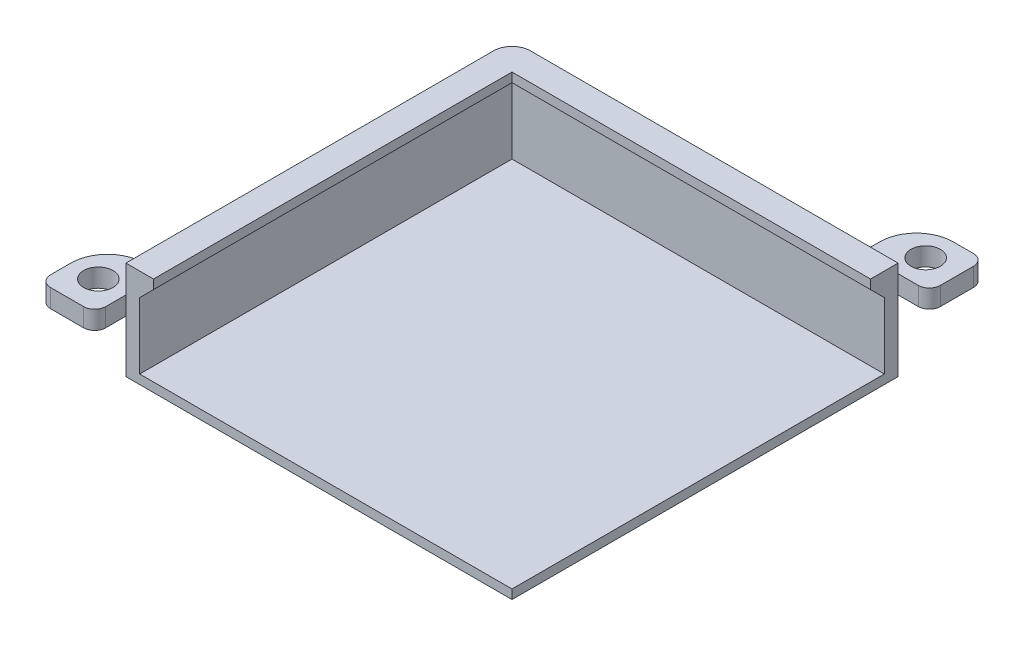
ISO-10303-21;
HEADER;
FILE_DESCRIPTION(('STEP AP214'),'2;1');
FILE_NAME('part.step','',(''),(''),'','','');
FILE_SCHEMA(('AUTOMOTIVE_DESIGN { 1 0 10303 214 1 1 1 1 }'));
ENDSEC;
DATA;
#1=APPLICATION_CONTEXT('core data for automotive mechanical design processes');
#2=APPLICATION_PROTOCOL_DEFINITION('international standard','automotive_design',2000,#1);
#3=PRODUCT_CONTEXT('',#1,'mechanical');
#4=PRODUCT('Part','Part','',(#3));
#5=PRODUCT_RELATED_PRODUCT_CATEGORY('part','',(#4));
#6=PRODUCT_DEFINITION_FORMATION('','',#4);
#7=PRODUCT_DEFINITION_CONTEXT('part definition',#1,'design');
#8=PRODUCT_DEFINITION('design','',#6,#7);
#9=PRODUCT_DEFINITION_SHAPE('','',#8);
#10=(LENGTH_UNIT() NAMED_UNIT(*) SI_UNIT(.MILLI.,.METRE.));
#11=(NAMED_UNIT(*) PLANE_ANGLE_UNIT() SI_UNIT($,.RADIAN.));
#12=(NAMED_UNIT(*) SI_UNIT($,.STERADIAN.) SOLID_ANGLE_UNIT());
#13=UNCERTAINTY_MEASURE_WITH_UNIT(LENGTH_MEASURE(1.E-05),#10,'distance_accuracy_value','');
#14=(GEOMETRIC_REPRESENTATION_CONTEXT(3) GLOBAL_UNCERTAINTY_ASSIGNED_CONTEXT((#13)) GLOBAL_UNIT_ASSIGNED_CONTEXT((#10,
#11,#12)) REPRESENTATION_CONTEXT('',''));
#15=CARTESIAN_POINT('',(0.,0.,0.));
#16=DIRECTION('',(0.,0.,1.));
#17=DIRECTION('',(1.,0.,0.));
#18=AXIS2_PLACEMENT_3D('',#15,#16,#17);
#19=CARTESIAN_POINT('',(-2.09403735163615,45.3038246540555,-96.5940373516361));
#20=DIRECTION('',(0.,-1.,0.));
#21=DIRECTION('',(0.,0.,-1.));
#22=AXIS2_PLACEMENT_3D('',#19,#20,#21);
#23=PLANE('',#22);
#24=CARTESIAN_POINT('',(92.4059626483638,45.3038246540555,-110.094037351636));
#25=DIRECTION('',(0.,1.,0.));
#26=DIRECTION('',(0.,0.,1.));
#27=AXIS2_PLACEMENT_3D('',#24,#25,#26);
#28=CIRCLE('',#27,7.19999999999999);
#29=CARTESIAN_POINT('',(92.4059626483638,45.3038246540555,-102.894037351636));
#30=VERTEX_POINT('',#29);
#31=EDGE_CURVE('E284',#30,#30,#28,.T.);
#32=ORIENTED_EDGE('',*,*,#31,.F.);
#33=EDGE_LOOP('',(#32));
#34=FACE_BOUND('',#33,.T.);
#35=DIRECTION('',(-1.,0.,0.));
#36=VECTOR('',#35,1.);
#37=CARTESIAN_POINT('',(92.4059626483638,45.3038246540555,-96.5940373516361));
#38=LINE('',#37,#36);
#39=CARTESIAN_POINT('',(92.4059626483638,45.3038246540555,-96.5940373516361));
#40=VERTEX_POINT('',#39);
#41=CARTESIAN_POINT('',(74.4059626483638,45.3038246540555,-96.5940373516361));
#42=VERTEX_POINT('',#41);
#43=EDGE_CURVE('E253',#40,#42,#38,.T.);
#44=ORIENTED_EDGE('',*,*,#43,.F.);
#45=DIRECTION('',(1.,0.,0.));
#46=VECTOR('',#45,1.);
#47=CARTESIAN_POINT('',(-2.09403735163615,45.3038246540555,-96.5940373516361));
#48=LINE('',#47,#46);
#49=CARTESIAN_POINT('',(102.305962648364,45.3038246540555,-96.5940373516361));
#50=VERTEX_POINT('',#49);
#51=EDGE_CURVE('E364',#40,#50,#48,.T.);
#52=ORIENTED_EDGE('',*,*,#51,.T.);
#53=CARTESIAN_POINT('',(102.305962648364,45.3038246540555,-101.994037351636));
#54=DIRECTION('',(0.,-1.,0.));
#55=DIRECTION('',(0.,0.,-1.));
#56=AXIS2_PLACEMENT_3D('',#53,#54,#55);
#57=CIRCLE('',#56,5.4);
#58=CARTESIAN_POINT('',(107.705962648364,45.3038246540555,-101.994037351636));
#59=VERTEX_POINT('',#58);
#60=EDGE_CURVE('E49',#50,#59,#57,.F.);
#61=ORIENTED_EDGE('',*,*,#60,.T.);
#62=DIRECTION('',(0.,0.,1.));
#63=VECTOR('',#62,1.);
#64=CARTESIAN_POINT('',(107.705962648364,45.3038246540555,-96.5940373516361));
#65=LINE('',#64,#63);
#66=CARTESIAN_POINT('',(107.705962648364,45.3038246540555,-118.194037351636));
#67=VERTEX_POINT('',#66);
#68=EDGE_CURVE('E293',#67,#59,#65,.T.);
#69=ORIENTED_EDGE('',*,*,#68,.F.);
#70=CARTESIAN_POINT('',(102.305962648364,45.3038246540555,-118.194037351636));
#71=DIRECTION('',(0.,-1.,0.));
#72=DIRECTION('',(0.,0.,-1.));
#73=AXIS2_PLACEMENT_3D('',#70,#71,#72);
#74=CIRCLE('',#73,5.4);
#75=CARTESIAN_POINT('',(102.305962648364,45.3038246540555,-123.594037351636));
#76=VERTEX_POINT('',#75);
#77=EDGE_CURVE('E56',#67,#76,#74,.F.);
#78=ORIENTED_EDGE('',*,*,#77,.T.);
#79=DIRECTION('',(1.,0.,0.));
#80=VECTOR('',#79,1.);
#81=CARTESIAN_POINT('',(-2.09403735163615,45.3038246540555,-123.594037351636));
#82=LINE('',#81,#80);
#83=CARTESIAN_POINT('',(92.4059626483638,45.3038246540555,-123.594037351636));
#84=VERTEX_POINT('',#83);
#85=EDGE_CURVE('E380',#84,#76,#82,.T.);
#86=ORIENTED_EDGE('',*,*,#85,.F.);
#87=CARTESIAN_POINT('',(92.4059626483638,45.3038246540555,-105.594037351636));
#88=DIRECTION('',(0.,1.,0.));
#89=DIRECTION('',(0.,0.,1.));
#90=AXIS2_PLACEMENT_3D('',#87,#88,#89);
#91=CIRCLE('',#90,18.);
#92=CARTESIAN_POINT('',(74.4059626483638,45.3038246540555,-105.594037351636));
#93=VERTEX_POINT('',#92);
#94=EDGE_CURVE('E369',#84,#93,#91,.T.);
#95=ORIENTED_EDGE('',*,*,#94,.T.);
#96=DIRECTION('',(0.,0.,1.));
#97=VECTOR('',#96,1.);
#98=CARTESIAN_POINT('',(74.4059626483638,45.3038246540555,-105.594037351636));
#99=LINE('',#98,#97);
#100=EDGE_CURVE('E397',#93,#42,#99,.T.);
#101=ORIENTED_EDGE('',*,*,#100,.T.);
#102=EDGE_LOOP('',(#44,#52,#61,#69,#78,#86,#95,#101));
#103=FACE_BOUND('',#102,.T.);
#104=ADVANCED_FACE('F40',(#34,#103),#23,.F.);
#105=CARTESIAN_POINT('',(-105.594037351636,27.3038246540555,92.4059626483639));
#106=DIRECTION('',(0.,1.,0.));
#107=DIRECTION('',(0.,0.,1.));
#108=AXIS2_PLACEMENT_3D('',#105,#106,#107);
#109=PLANE('',#108);
#110=CARTESIAN_POINT('',(-110.094037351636,27.3038246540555,92.4059626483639));
#111=DIRECTION('',(0.,1.,0.));
#112=DIRECTION('',(0.,0.,1.));
#113=AXIS2_PLACEMENT_3D('',#110,#111,#112);
#114=CIRCLE('',#113,7.20000000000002);
#115=CARTESIAN_POINT('',(-110.094037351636,27.3038246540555,99.6059626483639));
#116=VERTEX_POINT('',#115);
#117=EDGE_CURVE('E309',#116,#116,#114,.T.);
#118=ORIENTED_EDGE('',*,*,#117,.T.);
#119=EDGE_LOOP('',(#118));
#120=FACE_BOUND('',#119,.T.);
#121=DIRECTION('',(1.,0.,0.));
#122=VECTOR('',#121,1.);
#123=CARTESIAN_POINT('',(-123.594037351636,27.3038246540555,107.705962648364));
#124=LINE('',#123,#122);
#125=CARTESIAN_POINT('',(-118.194037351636,27.3038246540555,107.705962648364));
#126=VERTEX_POINT('',#125);
#127=CARTESIAN_POINT('',(-101.994037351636,27.3038246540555,107.705962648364));
#128=VERTEX_POINT('',#127);
#129=EDGE_CURVE('E297',#126,#128,#124,.T.);
#130=ORIENTED_EDGE('',*,*,#129,.F.);
#131=CARTESIAN_POINT('',(-118.194037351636,27.3038246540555,102.305962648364));
#132=DIRECTION('',(0.,1.,0.));
#133=DIRECTION('',(0.,0.,1.));
#134=AXIS2_PLACEMENT_3D('',#131,#132,#133);
#135=CIRCLE('',#134,5.4);
#136=CARTESIAN_POINT('',(-123.594037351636,27.3038246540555,102.305962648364));
#137=VERTEX_POINT('',#136);
#138=EDGE_CURVE('E504',#126,#137,#135,.F.);
#139=ORIENTED_EDGE('',*,*,#138,.T.);
#140=DIRECTION('',(0.,0.,1.));
#141=VECTOR('',#140,1.);
#142=CARTESIAN_POINT('',(-123.594037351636,27.3038246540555,-2.09403735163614));
#143=LINE('',#142,#141);
#144=CARTESIAN_POINT('',(-123.594037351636,27.3038246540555,92.4059626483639));
#145=VERTEX_POINT('',#144);
#146=EDGE_CURVE('E318',#145,#137,#143,.T.);
#147=ORIENTED_EDGE('',*,*,#146,.F.);
#148=CARTESIAN_POINT('',(-105.594037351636,27.3038246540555,92.4059626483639));
#149=DIRECTION('',(0.,1.,0.));
#150=DIRECTION('',(0.,0.,1.));
#151=AXIS2_PLACEMENT_3D('',#148,#149,#150);
#152=CIRCLE('',#151,18.);
#153=CARTESIAN_POINT('',(-105.594037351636,27.3038246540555,74.4059626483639));
#154=VERTEX_POINT('',#153);
#155=EDGE_CURVE('E314',#154,#145,#152,.T.);
#156=ORIENTED_EDGE('',*,*,#155,.F.);
#157=DIRECTION('',(1.,0.,0.));
#158=VECTOR('',#157,1.);
#159=CARTESIAN_POINT('',(-105.594037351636,27.3038246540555,74.4059626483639));
#160=LINE('',#159,#158);
#161=CARTESIAN_POINT('',(-96.5940373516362,27.3038246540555,74.4059626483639));
#162=VERTEX_POINT('',#161);
#163=EDGE_CURVE('E361',#154,#162,#160,.T.);
#164=ORIENTED_EDGE('',*,*,#163,.T.);
#165=DIRECTION('',(0.,0.,1.));
#166=VECTOR('',#165,1.);
#167=CARTESIAN_POINT('',(-96.5940373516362,27.3038246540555,92.4059626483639));
#168=LINE('',#167,#166);
#169=CARTESIAN_POINT('',(-96.5940373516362,27.3038246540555,92.4059626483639));
#170=VERTEX_POINT('',#169);
#171=EDGE_CURVE('E352',#162,#170,#168,.T.);
#172=ORIENTED_EDGE('',*,*,#171,.T.);
#173=DIRECTION('',(0.,0.,1.));
#174=VECTOR('',#173,1.);
#175=CARTESIAN_POINT('',(-96.5940373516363,27.3038246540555,-2.09403735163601));
#176=LINE('',#175,#174);
#177=CARTESIAN_POINT('',(-96.5940373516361,27.3038246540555,102.305962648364));
#178=VERTEX_POINT('',#177);
#179=EDGE_CURVE('E323',#170,#178,#176,.T.);
#180=ORIENTED_EDGE('',*,*,#179,.T.);
#181=CARTESIAN_POINT('',(-101.994037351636,27.3038246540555,102.305962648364));
#182=DIRECTION('',(0.,1.,0.));
#183=DIRECTION('',(0.,0.,1.));
#184=AXIS2_PLACEMENT_3D('',#181,#182,#183);
#185=CIRCLE('',#184,5.4);
#186=EDGE_CURVE('E501',#178,#128,#185,.F.);
#187=ORIENTED_EDGE('',*,*,#186,.T.);
#188=EDGE_LOOP('',(#130,#139,#147,#156,#164,#172,#180,#187));
#189=FACE_BOUND('',#188,.T.);
#190=ADVANCED_FACE('F610',(#120,#189),#109,.F.);
#191=CARTESIAN_POINT('',(-105.594037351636,36.3038246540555,92.4059626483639));
#192=DIRECTION('',(0.,-1.,0.));
#193=DIRECTION('',(0.,0.,-1.));
#194=AXIS2_PLACEMENT_3D('',#191,#192,#193);
#195=PLANE('',#194);
#196=CARTESIAN_POINT('',(-110.094037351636,36.3038246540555,92.4059626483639));
#197=DIRECTION('',(0.,1.,0.));
#198=DIRECTION('',(0.,0.,1.));
#199=AXIS2_PLACEMENT_3D('',#196,#197,#198);
#200=CIRCLE('',#199,7.20000000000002);
#201=CARTESIAN_POINT('',(-110.094037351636,36.3038246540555,99.6059626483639));
#202=VERTEX_POINT('',#201);
#203=EDGE_CURVE('E305',#202,#202,#200,.T.);
#204=ORIENTED_EDGE('',*,*,#203,.F.);
#205=EDGE_LOOP('',(#204));
#206=FACE_BOUND('',#205,.T.);
#207=DIRECTION('',(0.,0.,1.));
#208=VECTOR('',#207,1.);
#209=CARTESIAN_POINT('',(-123.594037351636,36.3038246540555,-2.09403735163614));
#210=LINE('',#209,#208);
#211=CARTESIAN_POINT('',(-123.594037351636,36.3038246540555,92.4059626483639));
#212=VERTEX_POINT('',#211);
#213=CARTESIAN_POINT('',(-123.594037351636,36.3038246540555,102.305962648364));
#214=VERTEX_POINT('',#213);
#215=EDGE_CURVE('E331',#212,#214,#210,.T.);
#216=ORIENTED_EDGE('',*,*,#215,.T.);
#217=CARTESIAN_POINT('',(-118.194037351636,36.3038246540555,102.305962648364));
#218=DIRECTION('',(0.,-1.,0.));
#219=DIRECTION('',(0.,0.,-1.));
#220=AXIS2_PLACEMENT_3D('',#217,#218,#219);
#221=CIRCLE('',#220,5.4);
#222=CARTESIAN_POINT('',(-118.194037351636,36.3038246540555,107.705962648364));
#223=VERTEX_POINT('',#222);
#224=EDGE_CURVE('E513',#214,#223,#221,.F.);
#225=ORIENTED_EDGE('',*,*,#224,.T.);
#226=DIRECTION('',(-1.,0.,0.));
#227=VECTOR('',#226,1.);
#228=CARTESIAN_POINT('',(-123.594037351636,36.3038246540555,107.705962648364));
#229=LINE('',#228,#227);
#230=CARTESIAN_POINT('',(-101.994037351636,36.3038246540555,107.705962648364));
#231=VERTEX_POINT('',#230);
#232=EDGE_CURVE('E301',#231,#223,#229,.T.);
#233=ORIENTED_EDGE('',*,*,#232,.F.);
#234=CARTESIAN_POINT('',(-101.994037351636,36.3038246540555,102.305962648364));
#235=DIRECTION('',(0.,-1.,0.));
#236=DIRECTION('',(0.,0.,-1.));
#237=AXIS2_PLACEMENT_3D('',#234,#235,#236);
#238=CIRCLE('',#237,5.4);
#239=CARTESIAN_POINT('',(-96.5940373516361,36.3038246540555,102.305962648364));
#240=VERTEX_POINT('',#239);
#241=EDGE_CURVE('E510',#231,#240,#238,.F.);
#242=ORIENTED_EDGE('',*,*,#241,.T.);
#243=DIRECTION('',(0.,0.,1.));
#244=VECTOR('',#243,1.);
#245=CARTESIAN_POINT('',(-96.5940373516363,36.3038246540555,-2.09403735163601));
#246=LINE('',#245,#244);
#247=CARTESIAN_POINT('',(-96.5940373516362,36.3038246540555,92.4059626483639));
#248=VERTEX_POINT('',#247);
#249=EDGE_CURVE('E319',#248,#240,#246,.T.);
#250=ORIENTED_EDGE('',*,*,#249,.F.);
#251=DIRECTION('',(0.,0.,-1.));
#252=VECTOR('',#251,1.);
#253=CARTESIAN_POINT('',(-96.5940373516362,36.3038246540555,92.4059626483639));
#254=LINE('',#253,#252);
#255=CARTESIAN_POINT('',(-96.5940373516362,36.3038246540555,74.4059626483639));
#256=VERTEX_POINT('',#255);
#257=EDGE_CURVE('E230',#248,#256,#254,.T.);
#258=ORIENTED_EDGE('',*,*,#257,.T.);
#259=DIRECTION('',(1.,0.,0.));
#260=VECTOR('',#259,1.);
#261=CARTESIAN_POINT('',(-105.594037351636,36.3038246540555,74.4059626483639));
#262=LINE('',#261,#260);
#263=CARTESIAN_POINT('',(-105.594037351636,36.3038246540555,74.4059626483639));
#264=VERTEX_POINT('',#263);
#265=EDGE_CURVE('E348',#264,#256,#262,.T.);
#266=ORIENTED_EDGE('',*,*,#265,.F.);
#267=CARTESIAN_POINT('',(-105.594037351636,36.3038246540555,92.4059626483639));
#268=DIRECTION('',(0.,1.,0.));
#269=DIRECTION('',(0.,0.,1.));
#270=AXIS2_PLACEMENT_3D('',#267,#268,#269);
#271=CIRCLE('',#270,18.);
#272=EDGE_CURVE('E313',#264,#212,#271,.T.);
#273=ORIENTED_EDGE('',*,*,#272,.T.);
#274=EDGE_LOOP('',(#216,#225,#233,#242,#250,#258,#266,#273));
#275=FACE_BOUND('',#274,.T.);
#276=ADVANCED_FACE('F616',(#206,#275),#195,.F.);
#277=CARTESIAN_POINT('',(-96.5940373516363,27.3038246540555,-2.09403735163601));
#278=DIRECTION('',(-1.,0.,0.));
#279=DIRECTION('',(0.,0.,1.));
#280=AXIS2_PLACEMENT_3D('',#277,#278,#279);
#281=PLANE('',#280);
#282=ORIENTED_EDGE('',*,*,#249,.T.);
#283=DIRECTION('',(0.,1.,0.));
#284=VECTOR('',#283,1.);
#285=CARTESIAN_POINT('',(-96.5940373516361,27.3038246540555,102.305962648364));
#286=LINE('',#285,#284);
#287=EDGE_CURVE('E516',#240,#178,#286,.F.);
#288=ORIENTED_EDGE('',*,*,#287,.T.);
#289=ORIENTED_EDGE('',*,*,#179,.F.);
#290=DIRECTION('',(0.,1.,0.));
#291=VECTOR('',#290,1.);
#292=CARTESIAN_POINT('',(-96.5940373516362,27.3038246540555,92.4059626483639));
#293=LINE('',#292,#291);
#294=EDGE_CURVE('E338',#170,#248,#293,.T.);
#295=ORIENTED_EDGE('',*,*,#294,.T.);
#296=EDGE_LOOP('',(#282,#288,#289,#295));
#297=FACE_BOUND('',#296,.T.);
#298=ADVANCED_FACE('F930',(#297),#281,.F.);
#299=CARTESIAN_POINT('',(-123.594037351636,27.3038246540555,-2.09403735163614));
#300=DIRECTION('',(-1.,0.,0.));
#301=DIRECTION('',(0.,0.,1.));
#302=AXIS2_PLACEMENT_3D('',#299,#300,#301);
#303=PLANE('',#302);
#304=ORIENTED_EDGE('',*,*,#146,.T.);
#305=DIRECTION('',(0.,-1.,0.));
#306=VECTOR('',#305,1.);
#307=CARTESIAN_POINT('',(-123.594037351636,27.3038246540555,102.305962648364));
#308=LINE('',#307,#306);
#309=EDGE_CURVE('E507',#137,#214,#308,.F.);
#310=ORIENTED_EDGE('',*,*,#309,.T.);
#311=ORIENTED_EDGE('',*,*,#215,.F.);
#312=DIRECTION('',(0.,1.,0.));
#313=VECTOR('',#312,1.);
#314=CARTESIAN_POINT('',(-123.594037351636,27.3038246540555,92.4059626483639));
#315=LINE('',#314,#313);
#316=EDGE_CURVE('E327',#145,#212,#315,.T.);
#317=ORIENTED_EDGE('',*,*,#316,.F.);
#318=EDGE_LOOP('',(#304,#310,#311,#317));
#319=FACE_BOUND('',#318,.T.);
#320=ADVANCED_FACE('F633',(#319),#303,.T.);
#321=CARTESIAN_POINT('',(-96.5940373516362,6.15382465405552,92.4059626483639));
#322=DIRECTION('',(0.,0.,-1.));
#323=DIRECTION('',(-1.,0.,0.));
#324=AXIS2_PLACEMENT_3D('',#321,#322,#323);
#325=PLANE('',#324);
#326=ORIENTED_EDGE('',*,*,#294,.F.);
#327=DIRECTION('',(0.,-1.,0.));
#328=VECTOR('',#327,1.);
#329=CARTESIAN_POINT('',(-96.5940373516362,6.15382465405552,92.4059626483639));
#330=LINE('',#329,#328);
#331=CARTESIAN_POINT('',(-96.5940373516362,1.65382465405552,92.4059626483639));
#332=VERTEX_POINT('',#331);
#333=EDGE_CURVE('E235',#170,#332,#330,.T.);
#334=ORIENTED_EDGE('',*,*,#333,.T.);
#335=DIRECTION('',(1.,0.,0.));
#336=VECTOR('',#335,1.);
#337=CARTESIAN_POINT('',(-96.5940373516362,1.65382465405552,92.4059626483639));
#338=LINE('',#337,#336);
#339=CARTESIAN_POINT('',(92.4059626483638,1.65382465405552,92.4059626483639));
#340=VERTEX_POINT('',#339);
#341=EDGE_CURVE('E452',#332,#340,#338,.T.);
#342=ORIENTED_EDGE('',*,*,#341,.T.);
#343=DIRECTION('',(0.,-1.,0.));
#344=VECTOR('',#343,1.);
#345=CARTESIAN_POINT('',(92.4059626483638,6.15382465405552,92.4059626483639));
#346=LINE('',#345,#344);
#347=CARTESIAN_POINT('',(92.4059626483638,6.15382465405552,92.4059626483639));
#348=VERTEX_POINT('',#347);
#349=EDGE_CURVE('E455',#348,#340,#346,.T.);
#350=ORIENTED_EDGE('',*,*,#349,.F.);
#351=DIRECTION('',(1.,0.,0.));
#352=VECTOR('',#351,1.);
#353=CARTESIAN_POINT('',(-96.5940373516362,6.15382465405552,92.4059626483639));
#354=LINE('',#353,#352);
#355=CARTESIAN_POINT('',(-89.8440373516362,6.15382465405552,92.4059626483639));
#356=VERTEX_POINT('',#355);
#357=EDGE_CURVE('E451',#356,#348,#354,.T.);
#358=ORIENTED_EDGE('',*,*,#357,.F.);
#359=DIRECTION('',(0.,1.,0.));
#360=VECTOR('',#359,1.);
#361=CARTESIAN_POINT('',(-89.8440373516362,1.65382465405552,92.4059626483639));
#362=LINE('',#361,#360);
#363=CARTESIAN_POINT('',(-89.8440373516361,38.5538246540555,92.4059626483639));
#364=VERTEX_POINT('',#363);
#365=EDGE_CURVE('E424',#356,#364,#362,.T.);
#366=ORIENTED_EDGE('',*,*,#365,.T.);
#367=DIRECTION('',(0.707106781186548,0.707106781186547,0.));
#368=VECTOR('',#367,1.);
#369=CARTESIAN_POINT('',(-64.4190373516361,63.9788246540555,92.4059626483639));
#370=LINE('',#369,#368);
#371=CARTESIAN_POINT('',(-83.0940373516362,45.3038246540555,92.4059626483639));
#372=VERTEX_POINT('',#371);
#373=EDGE_CURVE('E434',#364,#372,#370,.T.);
#374=ORIENTED_EDGE('',*,*,#373,.T.);
#375=DIRECTION('',(0.,-1.,0.));
#376=VECTOR('',#375,1.);
#377=CARTESIAN_POINT('',(-83.0940373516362,49.8038246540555,92.4059626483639));
#378=LINE('',#377,#376);
#379=CARTESIAN_POINT('',(-83.0940373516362,49.8038246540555,92.4059626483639));
#380=VERTEX_POINT('',#379);
#381=EDGE_CURVE('E241',#380,#372,#378,.T.);
#382=ORIENTED_EDGE('',*,*,#381,.F.);
#383=DIRECTION('',(1.,0.,0.));
#384=VECTOR('',#383,1.);
#385=CARTESIAN_POINT('',(-96.5940373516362,49.8038246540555,92.4059626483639));
#386=LINE('',#385,#384);
#387=CARTESIAN_POINT('',(-96.5940373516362,49.8038246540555,92.4059626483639));
#388=VERTEX_POINT('',#387);
#389=EDGE_CURVE('E238',#388,#380,#386,.T.);
#390=ORIENTED_EDGE('',*,*,#389,.F.);
#391=EDGE_CURVE('E222',#388,#248,#330,.T.);
#392=ORIENTED_EDGE('',*,*,#391,.T.);
#393=EDGE_LOOP('',(#326,#334,#342,#350,#358,#366,#374,#382,#390,#392));
#394=FACE_BOUND('',#393,.T.);
#395=ADVANCED_FACE('F239',(#394),#325,.F.);
#396=CARTESIAN_POINT('',(-96.5940373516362,6.15382465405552,92.4059626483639));
#397=DIRECTION('',(1.,0.,0.));
#398=DIRECTION('',(0.,0.,-1.));
#399=AXIS2_PLACEMENT_3D('',#396,#397,#398);
#400=PLANE('',#399);
#401=ORIENTED_EDGE('',*,*,#171,.F.);
#402=DIRECTION('',(0.,-1.,0.));
#403=VECTOR('',#402,1.);
#404=CARTESIAN_POINT('',(-96.5940373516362,36.3038246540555,74.4059626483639));
#405=LINE('',#404,#403);
#406=EDGE_CURVE('E341',#256,#162,#405,.T.);
#407=ORIENTED_EDGE('',*,*,#406,.F.);
#408=ORIENTED_EDGE('',*,*,#257,.F.);
#409=ORIENTED_EDGE('',*,*,#391,.F.);
#410=DIRECTION('',(0.,0.,1.));
#411=VECTOR('',#410,1.);
#412=CARTESIAN_POINT('',(-96.5940373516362,49.8038246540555,92.4059626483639));
#413=LINE('',#412,#411);
#414=CARTESIAN_POINT('',(-96.5940373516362,49.8038246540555,-87.5940373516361));
#415=VERTEX_POINT('',#414);
#416=EDGE_CURVE('E228',#415,#388,#413,.T.);
#417=ORIENTED_EDGE('',*,*,#416,.F.);
#418=DIRECTION('',(0.,-1.,0.));
#419=VECTOR('',#418,1.);
#420=CARTESIAN_POINT('',(-96.5940373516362,6.15382465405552,-87.5940373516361));
#421=LINE('',#420,#419);
#422=CARTESIAN_POINT('',(-96.5940373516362,1.65382465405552,-87.5940373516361));
#423=VERTEX_POINT('',#422);
#424=EDGE_CURVE('E481',#415,#423,#421,.T.);
#425=ORIENTED_EDGE('',*,*,#424,.T.);
#426=DIRECTION('',(0.,0.,1.));
#427=VECTOR('',#426,1.);
#428=CARTESIAN_POINT('',(-96.5940373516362,1.65382465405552,92.4059626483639));
#429=LINE('',#428,#427);
#430=EDGE_CURVE('E463',#423,#332,#429,.T.);
#431=ORIENTED_EDGE('',*,*,#430,.T.);
#432=ORIENTED_EDGE('',*,*,#333,.F.);
#433=EDGE_LOOP('',(#401,#407,#408,#409,#417,#425,#431,#432));
#434=FACE_BOUND('',#433,.T.);
#435=ADVANCED_FACE('F225',(#434),#400,.F.);
#436=CARTESIAN_POINT('',(-96.5940373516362,6.15382465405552,-96.5940373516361));
#437=DIRECTION('',(0.,0.,1.));
#438=DIRECTION('',(1.,0.,0.));
#439=AXIS2_PLACEMENT_3D('',#436,#437,#438);
#440=PLANE('',#439);
#441=DIRECTION('',(-1.,0.,0.));
#442=VECTOR('',#441,1.);
#443=CARTESIAN_POINT('',(92.4059626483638,36.3038246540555,-96.5940373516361));
#444=LINE('',#443,#442);
#445=CARTESIAN_POINT('',(92.4059626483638,36.3038246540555,-96.5940373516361));
#446=VERTEX_POINT('',#445);
#447=CARTESIAN_POINT('',(74.4059626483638,36.3038246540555,-96.5940373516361));
#448=VERTEX_POINT('',#447);
#449=EDGE_CURVE('E390',#446,#448,#444,.T.);
#450=ORIENTED_EDGE('',*,*,#449,.F.);
#451=DIRECTION('',(0.,-1.,0.));
#452=VECTOR('',#451,1.);
#453=CARTESIAN_POINT('',(92.4059626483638,6.15382465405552,-96.5940373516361));
#454=LINE('',#453,#452);
#455=CARTESIAN_POINT('',(92.4059626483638,1.65382465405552,-96.5940373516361));
#456=VERTEX_POINT('',#455);
#457=EDGE_CURVE('E234',#446,#456,#454,.T.);
#458=ORIENTED_EDGE('',*,*,#457,.T.);
#459=DIRECTION('',(-1.,0.,0.));
#460=VECTOR('',#459,1.);
#461=CARTESIAN_POINT('',(-96.5940373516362,1.65382465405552,-96.5940373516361));
#462=LINE('',#461,#460);
#463=CARTESIAN_POINT('',(-87.5940373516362,1.65382465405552,-96.5940373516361));
#464=VERTEX_POINT('',#463);
#465=EDGE_CURVE('E459',#456,#464,#462,.T.);
#466=ORIENTED_EDGE('',*,*,#465,.T.);
#467=DIRECTION('',(0.,-1.,0.));
#468=VECTOR('',#467,1.);
#469=CARTESIAN_POINT('',(-87.5940373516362,6.15382465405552,-96.5940373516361));
#470=LINE('',#469,#468);
#471=CARTESIAN_POINT('',(-87.5940373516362,49.8038246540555,-96.5940373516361));
#472=VERTEX_POINT('',#471);
#473=EDGE_CURVE('E487',#464,#472,#470,.F.);
#474=ORIENTED_EDGE('',*,*,#473,.T.);
#475=DIRECTION('',(-1.,0.,0.));
#476=VECTOR('',#475,1.);
#477=CARTESIAN_POINT('',(92.4059626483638,49.8038246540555,-96.5940373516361));
#478=LINE('',#477,#476);
#479=CARTESIAN_POINT('',(92.4059626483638,49.8038246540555,-96.5940373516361));
#480=VERTEX_POINT('',#479);
#481=EDGE_CURVE('E266',#480,#472,#478,.T.);
#482=ORIENTED_EDGE('',*,*,#481,.F.);
#483=DIRECTION('',(0.,-1.,0.));
#484=VECTOR('',#483,1.);
#485=CARTESIAN_POINT('',(92.4059626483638,49.8038246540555,-96.5940373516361));
#486=LINE('',#485,#484);
#487=EDGE_CURVE('E270',#480,#40,#486,.T.);
#488=ORIENTED_EDGE('',*,*,#487,.T.);
#489=ORIENTED_EDGE('',*,*,#43,.T.);
#490=DIRECTION('',(0.,1.,0.));
#491=VECTOR('',#490,1.);
#492=CARTESIAN_POINT('',(74.4059626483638,45.3038246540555,-96.5940373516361));
#493=LINE('',#492,#491);
#494=EDGE_CURVE('E398',#448,#42,#493,.T.);
#495=ORIENTED_EDGE('',*,*,#494,.F.);
#496=EDGE_LOOP('',(#450,#458,#466,#474,#482,#488,#489,#495));
#497=FACE_BOUND('',#496,.T.);
#498=ADVANCED_FACE('F560',(#497),#440,.F.);
#499=CARTESIAN_POINT('',(-2.09403735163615,6.15382465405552,-2.09403735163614));
#500=DIRECTION('',(0.,-1.,0.));
#501=DIRECTION('',(0.,0.,-1.));
#502=AXIS2_PLACEMENT_3D('',#499,#500,#501);
#503=PLANE('',#502);
#504=DIRECTION('',(1.,0.,0.));
#505=VECTOR('',#504,1.);
#506=CARTESIAN_POINT('',(-96.5940373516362,6.15382465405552,-89.8440373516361));
#507=LINE('',#506,#505);
#508=CARTESIAN_POINT('',(-89.8440373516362,6.15382465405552,-89.8440373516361));
#509=VERTEX_POINT('',#508);
#510=CARTESIAN_POINT('',(92.4059626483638,6.15382465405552,-89.8440373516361));
#511=VERTEX_POINT('',#510);
#512=EDGE_CURVE('E420',#509,#511,#507,.T.);
#513=ORIENTED_EDGE('',*,*,#512,.F.);
#514=DIRECTION('',(0.,0.,1.));
#515=VECTOR('',#514,1.);
#516=CARTESIAN_POINT('',(-89.8440373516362,6.15382465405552,-96.5940373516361));
#517=LINE('',#516,#515);
#518=EDGE_CURVE('E437',#509,#356,#517,.T.);
#519=ORIENTED_EDGE('',*,*,#518,.T.);
#520=ORIENTED_EDGE('',*,*,#357,.T.);
#521=DIRECTION('',(0.,0.,-1.));
#522=VECTOR('',#521,1.);
#523=CARTESIAN_POINT('',(92.4059626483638,6.15382465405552,92.4059626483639));
#524=LINE('',#523,#522);
#525=EDGE_CURVE('E448',#348,#511,#524,.T.);
#526=ORIENTED_EDGE('',*,*,#525,.T.);
#527=EDGE_LOOP('',(#513,#519,#520,#526));
#528=FACE_BOUND('',#527,.T.);
#529=ADVANCED_FACE('F576',(#528),#503,.F.);
#530=CARTESIAN_POINT('',(-64.4190373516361,63.9788246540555,-96.5940373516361));
#531=DIRECTION('',(0.707106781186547,-0.707106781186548,0.));
#532=DIRECTION('',(0.707106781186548,0.707106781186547,0.));
#533=AXIS2_PLACEMENT_3D('',#530,#531,#532);
#534=PLANE('',#533);
#535=DIRECTION('',(0.,0.,1.));
#536=VECTOR('',#535,1.);
#537=CARTESIAN_POINT('',(-89.8440373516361,38.5538246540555,-96.5940373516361));
#538=LINE('',#537,#536);
#539=CARTESIAN_POINT('',(-89.8440373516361,38.5538246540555,-89.8440373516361));
#540=VERTEX_POINT('',#539);
#541=EDGE_CURVE('E443',#540,#364,#538,.T.);
#542=ORIENTED_EDGE('',*,*,#541,.F.);
#543=DIRECTION('',(0.577350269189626,0.577350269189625,0.577350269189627));
#544=VECTOR('',#543,1.);
#545=CARTESIAN_POINT('',(-75.1440373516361,53.2538246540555,-75.1440373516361));
#546=LINE('',#545,#544);
#547=CARTESIAN_POINT('',(-83.0940373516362,45.3038246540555,-83.0940373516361));
#548=VERTEX_POINT('',#547);
#549=EDGE_CURVE('E477',#540,#548,#546,.T.);
#550=ORIENTED_EDGE('',*,*,#549,.T.);
#551=DIRECTION('',(0.,0.,1.));
#552=VECTOR('',#551,1.);
#553=CARTESIAN_POINT('',(-83.0940373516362,45.3038246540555,-96.5940373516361));
#554=LINE('',#553,#552);
#555=EDGE_CURVE('E438',#548,#372,#554,.T.);
#556=ORIENTED_EDGE('',*,*,#555,.T.);
#557=ORIENTED_EDGE('',*,*,#373,.F.);
#558=EDGE_LOOP('',(#542,#550,#556,#557));
#559=FACE_BOUND('',#558,.T.);
#560=ADVANCED_FACE('F589',(#559),#534,.T.);
#561=CARTESIAN_POINT('',(-89.8440373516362,1.65382465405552,-96.5940373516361));
#562=DIRECTION('',(1.,0.,0.));
#563=DIRECTION('',(0.,0.,-1.));
#564=AXIS2_PLACEMENT_3D('',#561,#562,#563);
#565=PLANE('',#564);
#566=ORIENTED_EDGE('',*,*,#518,.F.);
#567=DIRECTION('',(0.,1.,0.));
#568=VECTOR('',#567,1.);
#569=CARTESIAN_POINT('',(-89.8440373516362,1.65382465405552,-89.8440373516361));
#570=LINE('',#569,#568);
#571=EDGE_CURVE('E474',#509,#540,#570,.T.);
#572=ORIENTED_EDGE('',*,*,#571,.T.);
#573=ORIENTED_EDGE('',*,*,#541,.T.);
#574=ORIENTED_EDGE('',*,*,#365,.F.);
#575=EDGE_LOOP('',(#566,#572,#573,#574));
#576=FACE_BOUND('',#575,.T.);
#577=ADVANCED_FACE('F584',(#576),#565,.T.);
#578=CARTESIAN_POINT('',(92.4059626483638,6.15382465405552,92.4059626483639));
#579=DIRECTION('',(-1.,0.,0.));
#580=DIRECTION('',(0.,0.,1.));
#581=AXIS2_PLACEMENT_3D('',#578,#579,#580);
#582=PLANE('',#581);
#583=ORIENTED_EDGE('',*,*,#457,.F.);
#584=DIRECTION('',(0.,1.,0.));
#585=VECTOR('',#584,1.);
#586=CARTESIAN_POINT('',(92.4059626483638,36.3038246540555,-96.5940373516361));
#587=LINE('',#586,#585);
#588=EDGE_CURVE('E386',#446,#40,#587,.T.);
#589=ORIENTED_EDGE('',*,*,#588,.T.);
#590=ORIENTED_EDGE('',*,*,#487,.F.);
#591=DIRECTION('',(0.,0.,-1.));
#592=VECTOR('',#591,1.);
#593=CARTESIAN_POINT('',(92.4059626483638,49.8038246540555,-83.0940373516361));
#594=LINE('',#593,#592);
#595=CARTESIAN_POINT('',(92.4059626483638,49.8038246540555,-83.0940373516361));
#596=VERTEX_POINT('',#595);
#597=EDGE_CURVE('E263',#596,#480,#594,.T.);
#598=ORIENTED_EDGE('',*,*,#597,.F.);
#599=DIRECTION('',(0.,-1.,0.));
#600=VECTOR('',#599,1.);
#601=CARTESIAN_POINT('',(92.4059626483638,49.8038246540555,-83.0940373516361));
#602=LINE('',#601,#600);
#603=CARTESIAN_POINT('',(92.4059626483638,45.3038246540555,-83.0940373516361));
#604=VERTEX_POINT('',#603);
#605=EDGE_CURVE('E274',#596,#604,#602,.T.);
#606=ORIENTED_EDGE('',*,*,#605,.T.);
#607=DIRECTION('',(0.,0.707106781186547,0.707106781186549));
#608=VECTOR('',#607,1.);
#609=CARTESIAN_POINT('',(92.4059626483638,63.9788246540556,-64.419037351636));
#610=LINE('',#609,#608);
#611=CARTESIAN_POINT('',(92.4059626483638,38.5538246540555,-89.8440373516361));
#612=VERTEX_POINT('',#611);
#613=EDGE_CURVE('E416',#612,#604,#610,.T.);
#614=ORIENTED_EDGE('',*,*,#613,.F.);
#615=DIRECTION('',(0.,1.,0.));
#616=VECTOR('',#615,1.);
#617=CARTESIAN_POINT('',(92.4059626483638,1.65382465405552,-89.8440373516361));
#618=LINE('',#617,#616);
#619=EDGE_CURVE('E412',#511,#612,#618,.T.);
#620=ORIENTED_EDGE('',*,*,#619,.F.);
#621=ORIENTED_EDGE('',*,*,#525,.F.);
#622=ORIENTED_EDGE('',*,*,#349,.T.);
#623=DIRECTION('',(0.,0.,-1.));
#624=VECTOR('',#623,1.);
#625=CARTESIAN_POINT('',(92.4059626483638,1.65382465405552,92.4059626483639));
#626=LINE('',#625,#624);
#627=EDGE_CURVE('E442',#340,#456,#626,.T.);
#628=ORIENTED_EDGE('',*,*,#627,.T.);
#629=EDGE_LOOP('',(#583,#589,#590,#598,#606,#614,#620,#621,#622,#628));
#630=FACE_BOUND('',#629,.T.);
#631=ADVANCED_FACE('F554',(#630),#582,.F.);
#632=CARTESIAN_POINT('',(-2.09403735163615,1.65382465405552,-2.09403735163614));
#633=DIRECTION('',(0.,-1.,0.));
#634=DIRECTION('',(0.,0.,-1.));
#635=AXIS2_PLACEMENT_3D('',#632,#633,#634);
#636=PLANE('',#635);
#637=ORIENTED_EDGE('',*,*,#430,.F.);
#638=CARTESIAN_POINT('',(-87.5940373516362,1.65382465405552,-87.5940373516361));
#639=DIRECTION('',(0.,-1.,0.));
#640=DIRECTION('',(0.,0.,-1.));
#641=AXIS2_PLACEMENT_3D('',#638,#639,#640);
#642=CIRCLE('',#641,9.);
#643=EDGE_CURVE('E484',#423,#464,#642,.T.);
#644=ORIENTED_EDGE('',*,*,#643,.T.);
#645=ORIENTED_EDGE('',*,*,#465,.F.);
#646=ORIENTED_EDGE('',*,*,#627,.F.);
#647=ORIENTED_EDGE('',*,*,#341,.F.);
#648=EDGE_LOOP('',(#637,#644,#645,#646,#647));
#649=FACE_BOUND('',#648,.T.);
#650=ADVANCED_FACE('F564',(#649),#636,.T.);
#651=CARTESIAN_POINT('',(-96.5940373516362,1.65382465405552,-89.8440373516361));
#652=DIRECTION('',(0.,0.,-1.));
#653=DIRECTION('',(-1.,0.,0.));
#654=AXIS2_PLACEMENT_3D('',#651,#652,#653);
#655=PLANE('',#654);
#656=ORIENTED_EDGE('',*,*,#571,.F.);
#657=ORIENTED_EDGE('',*,*,#512,.T.);
#658=ORIENTED_EDGE('',*,*,#619,.T.);
#659=DIRECTION('',(1.,0.,0.));
#660=VECTOR('',#659,1.);
#661=CARTESIAN_POINT('',(-96.5940373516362,38.5538246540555,-89.8440373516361));
#662=LINE('',#661,#660);
#663=EDGE_CURVE('E421',#540,#612,#662,.T.);
#664=ORIENTED_EDGE('',*,*,#663,.F.);
#665=EDGE_LOOP('',(#656,#657,#658,#664));
#666=FACE_BOUND('',#665,.T.);
#667=ADVANCED_FACE('F580',(#666),#655,.F.);
#668=CARTESIAN_POINT('',(-96.5940373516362,63.9788246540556,-64.419037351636));
#669=DIRECTION('',(0.,0.707106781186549,-0.707106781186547));
#670=DIRECTION('',(0.,0.707106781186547,0.707106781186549));
#671=AXIS2_PLACEMENT_3D('',#668,#669,#670);
#672=PLANE('',#671);
#673=ORIENTED_EDGE('',*,*,#549,.F.);
#674=ORIENTED_EDGE('',*,*,#663,.T.);
#675=ORIENTED_EDGE('',*,*,#613,.T.);
#676=DIRECTION('',(1.,0.,0.));
#677=VECTOR('',#676,1.);
#678=CARTESIAN_POINT('',(-96.5940373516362,45.3038246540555,-83.0940373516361));
#679=LINE('',#678,#677);
#680=EDGE_CURVE('E425',#548,#604,#679,.T.);
#681=ORIENTED_EDGE('',*,*,#680,.F.);
#682=EDGE_LOOP('',(#673,#674,#675,#681));
#683=FACE_BOUND('',#682,.T.);
#684=ADVANCED_FACE('F592',(#683),#672,.F.);
#685=CARTESIAN_POINT('',(-87.5940373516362,6.15382465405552,-87.5940373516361));
#686=DIRECTION('',(0.,-1.,0.));
#687=DIRECTION('',(0.,0.,-1.));
#688=AXIS2_PLACEMENT_3D('',#685,#686,#687);
#689=CYLINDRICAL_SURFACE('',#688,9.);
#690=ORIENTED_EDGE('',*,*,#424,.F.);
#691=CARTESIAN_POINT('',(-87.5940373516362,49.8038246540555,-87.5940373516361));
#692=DIRECTION('',(0.,1.,0.));
#693=DIRECTION('',(0.,0.,1.));
#694=AXIS2_PLACEMENT_3D('',#691,#692,#693);
#695=CIRCLE('',#694,8.99999999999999);
#696=EDGE_CURVE('E251',#472,#415,#695,.T.);
#697=ORIENTED_EDGE('',*,*,#696,.F.);
#698=ORIENTED_EDGE('',*,*,#473,.F.);
#699=ORIENTED_EDGE('',*,*,#643,.F.);
#700=EDGE_LOOP('',(#690,#697,#698,#699));
#701=FACE_BOUND('',#700,.T.);
#702=ADVANCED_FACE('F567',(#701),#689,.T.);
#703=CARTESIAN_POINT('',(92.4059626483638,36.3038246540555,-105.594037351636));
#704=DIRECTION('',(0.,1.,0.));
#705=DIRECTION('',(0.,0.,1.));
#706=AXIS2_PLACEMENT_3D('',#703,#704,#705);
#707=PLANE('',#706);
#708=CARTESIAN_POINT('',(92.4059626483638,36.3038246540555,-110.094037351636));
#709=DIRECTION('',(0.,1.,0.));
#710=DIRECTION('',(0.,0.,1.));
#711=AXIS2_PLACEMENT_3D('',#708,#709,#710);
#712=CIRCLE('',#711,7.19999999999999);
#713=CARTESIAN_POINT('',(92.4059626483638,36.3038246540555,-102.894037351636));
#714=VERTEX_POINT('',#713);
#715=EDGE_CURVE('E288',#714,#714,#712,.T.);
#716=ORIENTED_EDGE('',*,*,#715,.T.);
#717=EDGE_LOOP('',(#716));
#718=FACE_BOUND('',#717,.T.);
#719=DIRECTION('',(0.,0.,-1.));
#720=VECTOR('',#719,1.);
#721=CARTESIAN_POINT('',(107.705962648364,36.3038246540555,-96.5940373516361));
#722=LINE('',#721,#720);
#723=CARTESIAN_POINT('',(107.705962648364,36.3038246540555,-101.994037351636));
#724=VERTEX_POINT('',#723);
#725=CARTESIAN_POINT('',(107.705962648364,36.3038246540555,-118.194037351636));
#726=VERTEX_POINT('',#725);
#727=EDGE_CURVE('E289',#724,#726,#722,.T.);
#728=ORIENTED_EDGE('',*,*,#727,.F.);
#729=CARTESIAN_POINT('',(102.305962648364,36.3038246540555,-101.994037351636));
#730=DIRECTION('',(0.,1.,0.));
#731=DIRECTION('',(0.,0.,1.));
#732=AXIS2_PLACEMENT_3D('',#729,#730,#731);
#733=CIRCLE('',#732,5.4);
#734=CARTESIAN_POINT('',(102.305962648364,36.3038246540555,-96.5940373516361));
#735=VERTEX_POINT('',#734);
#736=EDGE_CURVE('E530',#724,#735,#733,.F.);
#737=ORIENTED_EDGE('',*,*,#736,.T.);
#738=DIRECTION('',(1.,0.,0.));
#739=VECTOR('',#738,1.);
#740=CARTESIAN_POINT('',(-2.09403735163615,36.3038246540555,-96.5940373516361));
#741=LINE('',#740,#739);
#742=EDGE_CURVE('E365',#446,#735,#741,.T.);
#743=ORIENTED_EDGE('',*,*,#742,.F.);
#744=ORIENTED_EDGE('',*,*,#449,.T.);
#745=DIRECTION('',(0.,0.,1.));
#746=VECTOR('',#745,1.);
#747=CARTESIAN_POINT('',(74.4059626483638,36.3038246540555,-105.594037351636));
#748=LINE('',#747,#746);
#749=CARTESIAN_POINT('',(74.4059626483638,36.3038246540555,-105.594037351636));
#750=VERTEX_POINT('',#749);
#751=EDGE_CURVE('E408',#750,#448,#748,.T.);
#752=ORIENTED_EDGE('',*,*,#751,.F.);
#753=CARTESIAN_POINT('',(92.4059626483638,36.3038246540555,-105.594037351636));
#754=DIRECTION('',(0.,1.,0.));
#755=DIRECTION('',(0.,0.,1.));
#756=AXIS2_PLACEMENT_3D('',#753,#754,#755);
#757=CIRCLE('',#756,18.);
#758=CARTESIAN_POINT('',(92.4059626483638,36.3038246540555,-123.594037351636));
#759=VERTEX_POINT('',#758);
#760=EDGE_CURVE('E373',#759,#750,#757,.T.);
#761=ORIENTED_EDGE('',*,*,#760,.F.);
#762=DIRECTION('',(1.,0.,0.));
#763=VECTOR('',#762,1.);
#764=CARTESIAN_POINT('',(-2.09403735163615,36.3038246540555,-123.594037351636));
#765=LINE('',#764,#763);
#766=CARTESIAN_POINT('',(102.305962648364,36.3038246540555,-123.594037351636));
#767=VERTEX_POINT('',#766);
#768=EDGE_CURVE('E368',#759,#767,#765,.T.);
#769=ORIENTED_EDGE('',*,*,#768,.T.);
#770=CARTESIAN_POINT('',(102.305962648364,36.3038246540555,-118.194037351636));
#771=DIRECTION('',(0.,1.,0.));
#772=DIRECTION('',(0.,0.,1.));
#773=AXIS2_PLACEMENT_3D('',#770,#771,#772);
#774=CIRCLE('',#773,5.4);
#775=EDGE_CURVE('E527',#767,#726,#774,.F.);
#776=ORIENTED_EDGE('',*,*,#775,.T.);
#777=EDGE_LOOP('',(#728,#737,#743,#744,#752,#761,#769,#776));
#778=FACE_BOUND('',#777,.T.);
#779=ADVANCED_FACE('F548',(#718,#778),#707,.F.);
#780=CARTESIAN_POINT('',(74.4059626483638,45.3038246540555,-105.594037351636));
#781=DIRECTION('',(1.,0.,0.));
#782=DIRECTION('',(0.,0.,-1.));
#783=AXIS2_PLACEMENT_3D('',#780,#781,#782);
#784=PLANE('',#783);
#785=ORIENTED_EDGE('',*,*,#494,.T.);
#786=ORIENTED_EDGE('',*,*,#100,.F.);
#787=DIRECTION('',(0.,1.,0.));
#788=VECTOR('',#787,1.);
#789=CARTESIAN_POINT('',(74.4059626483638,45.3038246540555,-105.594037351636));
#790=LINE('',#789,#788);
#791=EDGE_CURVE('E393',#750,#93,#790,.T.);
#792=ORIENTED_EDGE('',*,*,#791,.F.);
#793=ORIENTED_EDGE('',*,*,#751,.T.);
#794=EDGE_LOOP('',(#785,#786,#792,#793));
#795=FACE_BOUND('',#794,.T.);
#796=ADVANCED_FACE('F898',(#795),#784,.F.);
#797=CARTESIAN_POINT('',(-2.09403735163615,36.3038246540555,-96.5940373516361));
#798=DIRECTION('',(0.,0.,1.));
#799=DIRECTION('',(1.,0.,0.));
#800=AXIS2_PLACEMENT_3D('',#797,#798,#799);
#801=PLANE('',#800);
#802=ORIENTED_EDGE('',*,*,#742,.T.);
#803=DIRECTION('',(0.,-1.,0.));
#804=VECTOR('',#803,1.);
#805=CARTESIAN_POINT('',(102.305962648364,45.3038246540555,-96.5940373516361));
#806=LINE('',#805,#804);
#807=EDGE_CURVE('E64',#735,#50,#806,.F.);
#808=ORIENTED_EDGE('',*,*,#807,.T.);
#809=ORIENTED_EDGE('',*,*,#51,.F.);
#810=ORIENTED_EDGE('',*,*,#588,.F.);
#811=EDGE_LOOP('',(#802,#808,#809,#810));
#812=FACE_BOUND('',#811,.T.);
#813=ADVANCED_FACE('F550',(#812),#801,.T.);
#814=CARTESIAN_POINT('',(92.4059626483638,36.3038246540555,-105.594037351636));
#815=DIRECTION('',(0.,1.,0.));
#816=DIRECTION('',(0.,0.,1.));
#817=AXIS2_PLACEMENT_3D('',#814,#815,#816);
#818=CYLINDRICAL_SURFACE('',#817,18.);
#819=ORIENTED_EDGE('',*,*,#94,.F.);
#820=DIRECTION('',(0.,1.,0.));
#821=VECTOR('',#820,1.);
#822=CARTESIAN_POINT('',(92.4059626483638,36.3038246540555,-123.594037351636));
#823=LINE('',#822,#821);
#824=EDGE_CURVE('E377',#759,#84,#823,.T.);
#825=ORIENTED_EDGE('',*,*,#824,.F.);
#826=ORIENTED_EDGE('',*,*,#760,.T.);
#827=ORIENTED_EDGE('',*,*,#791,.T.);
#828=EDGE_LOOP('',(#819,#825,#826,#827));
#829=FACE_BOUND('',#828,.T.);
#830=ADVANCED_FACE('F880',(#829),#818,.T.);
#831=CARTESIAN_POINT('',(-2.09403735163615,36.3038246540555,-123.594037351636));
#832=DIRECTION('',(0.,0.,1.));
#833=DIRECTION('',(1.,0.,0.));
#834=AXIS2_PLACEMENT_3D('',#831,#832,#833);
#835=PLANE('',#834);
#836=ORIENTED_EDGE('',*,*,#85,.T.);
#837=DIRECTION('',(0.,1.,0.));
#838=VECTOR('',#837,1.);
#839=CARTESIAN_POINT('',(102.305962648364,36.3038246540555,-123.594037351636));
#840=LINE('',#839,#838);
#841=EDGE_CURVE('E11',#76,#767,#840,.F.);
#842=ORIENTED_EDGE('',*,*,#841,.T.);
#843=ORIENTED_EDGE('',*,*,#768,.F.);
#844=ORIENTED_EDGE('',*,*,#824,.T.);
#845=EDGE_LOOP('',(#836,#842,#843,#844));
#846=FACE_BOUND('',#845,.T.);
#847=ADVANCED_FACE('F871',(#846),#835,.F.);
#848=CARTESIAN_POINT('',(-105.594037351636,36.3038246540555,74.4059626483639));
#849=DIRECTION('',(0.,0.,1.));
#850=DIRECTION('',(0.,-1.,0.));
#851=AXIS2_PLACEMENT_3D('',#848,#849,#850);
#852=PLANE('',#851);
#853=ORIENTED_EDGE('',*,*,#406,.T.);
#854=ORIENTED_EDGE('',*,*,#163,.F.);
#855=DIRECTION('',(0.,-1.,0.));
#856=VECTOR('',#855,1.);
#857=CARTESIAN_POINT('',(-105.594037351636,36.3038246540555,74.4059626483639));
#858=LINE('',#857,#856);
#859=EDGE_CURVE('E344',#264,#154,#858,.T.);
#860=ORIENTED_EDGE('',*,*,#859,.F.);
#861=ORIENTED_EDGE('',*,*,#265,.T.);
#862=EDGE_LOOP('',(#853,#854,#860,#861));
#863=FACE_BOUND('',#862,.T.);
#864=ADVANCED_FACE('F862',(#863),#852,.F.);
#865=CARTESIAN_POINT('',(-105.594037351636,27.3038246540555,92.4059626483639));
#866=DIRECTION('',(0.,1.,0.));
#867=DIRECTION('',(0.,0.,1.));
#868=AXIS2_PLACEMENT_3D('',#865,#866,#867);
#869=CYLINDRICAL_SURFACE('',#868,18.);
#870=ORIENTED_EDGE('',*,*,#272,.F.);
#871=ORIENTED_EDGE('',*,*,#859,.T.);
#872=ORIENTED_EDGE('',*,*,#155,.T.);
#873=ORIENTED_EDGE('',*,*,#316,.T.);
#874=EDGE_LOOP('',(#870,#871,#872,#873));
#875=FACE_BOUND('',#874,.T.);
#876=ADVANCED_FACE('F853',(#875),#869,.T.);
#877=CARTESIAN_POINT('',(-110.094037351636,1.65382465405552,92.4059626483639));
#878=DIRECTION('',(0.,1.,0.));
#879=DIRECTION('',(0.,0.,1.));
#880=AXIS2_PLACEMENT_3D('',#877,#878,#879);
#881=CYLINDRICAL_SURFACE('',#880,7.20000000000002);
#882=CARTESIAN_POINT('',(-110.094037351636,36.3038246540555,99.6059626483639));
#883=CARTESIAN_POINT('',(-110.094037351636,36.2100746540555,99.6059626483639));
#884=CARTESIAN_POINT('',(-110.094037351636,36.1163246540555,99.6059626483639));
#885=CARTESIAN_POINT('',(-110.094037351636,35.9288246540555,99.6059626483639));
#886=CARTESIAN_POINT('',(-110.094037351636,35.8350746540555,99.6059626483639));
#887=CARTESIAN_POINT('',(-110.094037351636,35.6475746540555,99.6059626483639));
#888=CARTESIAN_POINT('',(-110.094037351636,35.5538246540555,99.6059626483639));
#889=CARTESIAN_POINT('',(-110.094037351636,35.3663246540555,99.6059626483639));
#890=CARTESIAN_POINT('',(-110.094037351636,35.2725746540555,99.6059626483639));
#891=CARTESIAN_POINT('',(-110.094037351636,35.0850746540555,99.6059626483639));
#892=CARTESIAN_POINT('',(-110.094037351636,34.9913246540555,99.6059626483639));
#893=CARTESIAN_POINT('',(-110.094037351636,34.8038246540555,99.6059626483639));
#894=CARTESIAN_POINT('',(-110.094037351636,34.7100746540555,99.6059626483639));
#895=CARTESIAN_POINT('',(-110.094037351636,34.5225746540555,99.6059626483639));
#896=CARTESIAN_POINT('',(-110.094037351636,34.4288246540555,99.6059626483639));
#897=CARTESIAN_POINT('',(-110.094037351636,34.2413246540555,99.6059626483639));
#898=CARTESIAN_POINT('',(-110.094037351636,34.1475746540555,99.6059626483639));
#899=CARTESIAN_POINT('',(-110.094037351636,33.9600746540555,99.6059626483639));
#900=CARTESIAN_POINT('',(-110.094037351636,33.8663246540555,99.6059626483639));
#901=CARTESIAN_POINT('',(-110.094037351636,33.6788246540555,99.6059626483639));
#902=CARTESIAN_POINT('',(-110.094037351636,33.5850746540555,99.6059626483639));
#903=CARTESIAN_POINT('',(-110.094037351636,33.3975746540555,99.6059626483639));
#904=CARTESIAN_POINT('',(-110.094037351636,33.3038246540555,99.6059626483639));
#905=CARTESIAN_POINT('',(-110.094037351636,33.1163246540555,99.6059626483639));
#906=CARTESIAN_POINT('',(-110.094037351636,33.0225746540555,99.6059626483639));
#907=CARTESIAN_POINT('',(-110.094037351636,32.8350746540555,99.6059626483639));
#908=CARTESIAN_POINT('',(-110.094037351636,32.7413246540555,99.6059626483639));
#909=CARTESIAN_POINT('',(-110.094037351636,32.5538246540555,99.6059626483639));
#910=CARTESIAN_POINT('',(-110.094037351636,32.4600746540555,99.6059626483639));
#911=CARTESIAN_POINT('',(-110.094037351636,32.2725746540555,99.6059626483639));
#912=CARTESIAN_POINT('',(-110.094037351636,32.1788246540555,99.6059626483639));
#913=CARTESIAN_POINT('',(-110.094037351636,31.9913246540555,99.6059626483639));
#914=CARTESIAN_POINT('',(-110.094037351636,31.8975746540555,99.6059626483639));
#915=CARTESIAN_POINT('',(-110.094037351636,31.7100746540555,99.6059626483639));
#916=CARTESIAN_POINT('',(-110.094037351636,31.6163246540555,99.6059626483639));
#917=CARTESIAN_POINT('',(-110.094037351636,31.4288246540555,99.6059626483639));
#918=CARTESIAN_POINT('',(-110.094037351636,31.3350746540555,99.6059626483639));
#919=CARTESIAN_POINT('',(-110.094037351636,31.1475746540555,99.6059626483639));
#920=CARTESIAN_POINT('',(-110.094037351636,31.0538246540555,99.6059626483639));
#921=CARTESIAN_POINT('',(-110.094037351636,30.8663246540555,99.6059626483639));
#922=CARTESIAN_POINT('',(-110.094037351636,30.7725746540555,99.6059626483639));
#923=CARTESIAN_POINT('',(-110.094037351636,30.5850746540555,99.6059626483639));
#924=CARTESIAN_POINT('',(-110.094037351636,30.4913246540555,99.6059626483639));
#925=CARTESIAN_POINT('',(-110.094037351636,30.3038246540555,99.6059626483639));
#926=CARTESIAN_POINT('',(-110.094037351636,30.2100746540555,99.6059626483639));
#927=CARTESIAN_POINT('',(-110.094037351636,30.0225746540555,99.6059626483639));
#928=CARTESIAN_POINT('',(-110.094037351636,29.9288246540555,99.6059626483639));
#929=CARTESIAN_POINT('',(-110.094037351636,29.7413246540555,99.6059626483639));
#930=CARTESIAN_POINT('',(-110.094037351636,29.6475746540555,99.6059626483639));
#931=CARTESIAN_POINT('',(-110.094037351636,29.4600746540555,99.6059626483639));
#932=CARTESIAN_POINT('',(-110.094037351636,29.3663246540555,99.6059626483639));
#933=CARTESIAN_POINT('',(-110.094037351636,29.1788246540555,99.6059626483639));
#934=CARTESIAN_POINT('',(-110.094037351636,29.0850746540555,99.6059626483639));
#935=CARTESIAN_POINT('',(-110.094037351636,28.8975746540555,99.6059626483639));
#936=CARTESIAN_POINT('',(-110.094037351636,28.8038246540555,99.6059626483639));
#937=CARTESIAN_POINT('',(-110.094037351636,28.6163246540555,99.6059626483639));
#938=CARTESIAN_POINT('',(-110.094037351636,28.5225746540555,99.6059626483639));
#939=CARTESIAN_POINT('',(-110.094037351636,28.3350746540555,99.6059626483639));
#940=CARTESIAN_POINT('',(-110.094037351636,28.2413246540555,99.6059626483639));
#941=CARTESIAN_POINT('',(-110.094037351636,28.0538246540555,99.6059626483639));
#942=CARTESIAN_POINT('',(-110.094037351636,27.9600746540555,99.6059626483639));
#943=CARTESIAN_POINT('',(-110.094037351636,27.7725746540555,99.6059626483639));
#944=CARTESIAN_POINT('',(-110.094037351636,27.6788246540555,99.6059626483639));
#945=CARTESIAN_POINT('',(-110.094037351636,27.4913246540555,99.6059626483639));
#946=CARTESIAN_POINT('',(-110.094037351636,27.3975746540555,99.6059626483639));
#947=CARTESIAN_POINT('',(-110.094037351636,27.3038246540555,99.6059626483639));
#948=B_SPLINE_CURVE_WITH_KNOTS('',3,(#882,#883,#884,#885,#886,#887,#888,#889,#890,#891,#892,
#893,#894,#895,#896,#897,#898,#899,#900,#901,#902,#903,#904,#905,#906,#907,#908,#909,#910,#911,
#912,#913,#914,#915,#916,#917,#918,#919,#920,#921,#922,#923,#924,#925,#926,#927,#928,#929,#930,
#931,#932,#933,#934,#935,#936,#937,#938,#939,#940,#941,#942,#943,#944,#945,#946,#947),
.UNSPECIFIED.,.F.,.F.,(4,2,2,2,2,2,2,2,2,2,2,2,2,2,2,2,2,2,2,2,2,2,2,2,2,2,2,2,2,2,2,2,4),(0.,
0.281249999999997,0.5625,0.843750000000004,1.125,1.40625,1.6875,1.96875000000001,2.25,2.53125,
2.8125,3.09375000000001,3.375,3.65625,3.9375,4.21875,4.5,4.78125,5.0625,5.34375,5.625,5.90625,
6.1875,6.46875,6.75,7.03125,7.3125,7.59375,7.875,8.15625,8.4375,8.71875,9.00000000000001),.UNSPECIFIED.);
#949=EDGE_CURVE('BSEAM844',#202,#116,#948,.T.);
#950=ORIENTED_EDGE('',*,*,#203,.T.);
#951=ORIENTED_EDGE('',*,*,#117,.F.);
#952=ORIENTED_EDGE('',*,*,#949,.T.);
#953=ORIENTED_EDGE('',*,*,#949,.F.);
#954=EDGE_LOOP('',(#950,#952,#951,#953));
#955=FACE_BOUND('',#954,.T.);
#956=ADVANCED_FACE('F844',(#955),#881,.F.);
#957=CARTESIAN_POINT('',(-2.09403735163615,1.65382465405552,107.705962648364));
#958=DIRECTION('',(0.,0.,1.));
#959=DIRECTION('',(1.,0.,0.));
#960=AXIS2_PLACEMENT_3D('',#957,#958,#959);
#961=PLANE('',#960);
#962=ORIENTED_EDGE('',*,*,#232,.T.);
#963=DIRECTION('',(0.,-1.,0.));
#964=VECTOR('',#963,1.);
#965=CARTESIAN_POINT('',(-118.194037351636,1.65382465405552,107.705962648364));
#966=LINE('',#965,#964);
#967=EDGE_CURVE('E497',#223,#126,#966,.T.);
#968=ORIENTED_EDGE('',*,*,#967,.T.);
#969=ORIENTED_EDGE('',*,*,#129,.T.);
#970=DIRECTION('',(0.,1.,0.));
#971=VECTOR('',#970,1.);
#972=CARTESIAN_POINT('',(-101.994037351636,36.3038246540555,107.705962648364));
#973=LINE('',#972,#971);
#974=EDGE_CURVE('E490',#128,#231,#973,.T.);
#975=ORIENTED_EDGE('',*,*,#974,.T.);
#976=EDGE_LOOP('',(#962,#968,#969,#975));
#977=FACE_BOUND('',#976,.T.);
#978=ADVANCED_FACE('F836',(#977),#961,.T.);
#979=CARTESIAN_POINT('',(107.705962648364,1.65382465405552,-2.09403735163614));
#980=DIRECTION('',(-1.,0.,0.));
#981=DIRECTION('',(0.,0.,1.));
#982=AXIS2_PLACEMENT_3D('',#979,#980,#981);
#983=PLANE('',#982);
#984=ORIENTED_EDGE('',*,*,#68,.T.);
#985=DIRECTION('',(0.,-1.,0.));
#986=VECTOR('',#985,1.);
#987=CARTESIAN_POINT('',(107.705962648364,36.3038246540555,-101.994037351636));
#988=LINE('',#987,#986);
#989=EDGE_CURVE('E523',#59,#724,#988,.T.);
#990=ORIENTED_EDGE('',*,*,#989,.T.);
#991=ORIENTED_EDGE('',*,*,#727,.T.);
#992=DIRECTION('',(0.,1.,0.));
#993=VECTOR('',#992,1.);
#994=CARTESIAN_POINT('',(107.705962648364,1.65382465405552,-118.194037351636));
#995=LINE('',#994,#993);
#996=EDGE_CURVE('E519',#726,#67,#995,.T.);
#997=ORIENTED_EDGE('',*,*,#996,.T.);
#998=EDGE_LOOP('',(#984,#990,#991,#997));
#999=FACE_BOUND('',#998,.T.);
#1000=ADVANCED_FACE('F542',(#999),#983,.F.);
#1001=CARTESIAN_POINT('',(92.4059626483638,1.65382465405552,-110.094037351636));
#1002=DIRECTION('',(0.,1.,0.));
#1003=DIRECTION('',(0.,0.,1.));
#1004=AXIS2_PLACEMENT_3D('',#1001,#1002,#1003);
#1005=CYLINDRICAL_SURFACE('',#1004,7.19999999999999);
#1006=ORIENTED_EDGE('',*,*,#31,.T.);
#1007=EDGE_LOOP('',(#1006));
#1008=FACE_BOUND('',#1007,.T.);
#1009=ORIENTED_EDGE('',*,*,#715,.F.);
#1010=EDGE_LOOP('',(#1009));
#1011=FACE_BOUND('',#1010,.T.);
#1012=ADVANCED_FACE('F646',(#1008,#1011),#1005,.F.);
#1013=CARTESIAN_POINT('',(-118.194037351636,1.65382465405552,102.305962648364));
#1014=DIRECTION('',(0.,-1.,0.));
#1015=DIRECTION('',(0.,0.,-1.));
#1016=AXIS2_PLACEMENT_3D('',#1013,#1014,#1015);
#1017=CYLINDRICAL_SURFACE('',#1016,5.4);
#1018=ORIENTED_EDGE('',*,*,#224,.F.);
#1019=ORIENTED_EDGE('',*,*,#309,.F.);
#1020=ORIENTED_EDGE('',*,*,#138,.F.);
#1021=ORIENTED_EDGE('',*,*,#967,.F.);
#1022=EDGE_LOOP('',(#1018,#1019,#1020,#1021));
#1023=FACE_BOUND('',#1022,.T.);
#1024=ADVANCED_FACE('F642',(#1023),#1017,.T.);
#1025=CARTESIAN_POINT('',(-101.994037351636,1.65382465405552,102.305962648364));
#1026=DIRECTION('',(0.,-1.,0.));
#1027=DIRECTION('',(0.,0.,-1.));
#1028=AXIS2_PLACEMENT_3D('',#1025,#1026,#1027);
#1029=CYLINDRICAL_SURFACE('',#1028,5.4);
#1030=ORIENTED_EDGE('',*,*,#186,.F.);
#1031=ORIENTED_EDGE('',*,*,#287,.F.);
#1032=ORIENTED_EDGE('',*,*,#241,.F.);
#1033=ORIENTED_EDGE('',*,*,#974,.F.);
#1034=EDGE_LOOP('',(#1030,#1031,#1032,#1033));
#1035=FACE_BOUND('',#1034,.T.);
#1036=ADVANCED_FACE('F645',(#1035),#1029,.T.);
#1037=CARTESIAN_POINT('',(102.305962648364,1.65382465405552,-101.994037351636));
#1038=DIRECTION('',(0.,1.,0.));
#1039=DIRECTION('',(0.,0.,1.));
#1040=AXIS2_PLACEMENT_3D('',#1037,#1038,#1039);
#1041=CYLINDRICAL_SURFACE('',#1040,5.4);
#1042=ORIENTED_EDGE('',*,*,#60,.F.);
#1043=ORIENTED_EDGE('',*,*,#807,.F.);
#1044=ORIENTED_EDGE('',*,*,#736,.F.);
#1045=ORIENTED_EDGE('',*,*,#989,.F.);
#1046=EDGE_LOOP('',(#1042,#1043,#1044,#1045));
#1047=FACE_BOUND('',#1046,.T.);
#1048=ADVANCED_FACE('F545',(#1047),#1041,.T.);
#1049=CARTESIAN_POINT('',(102.305962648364,1.65382465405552,-118.194037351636));
#1050=DIRECTION('',(0.,1.,0.));
#1051=DIRECTION('',(0.,0.,1.));
#1052=AXIS2_PLACEMENT_3D('',#1049,#1050,#1051);
#1053=CYLINDRICAL_SURFACE('',#1052,5.4);
#1054=ORIENTED_EDGE('',*,*,#775,.F.);
#1055=ORIENTED_EDGE('',*,*,#841,.F.);
#1056=ORIENTED_EDGE('',*,*,#77,.F.);
#1057=ORIENTED_EDGE('',*,*,#996,.F.);
#1058=EDGE_LOOP('',(#1054,#1055,#1056,#1057));
#1059=FACE_BOUND('',#1058,.T.);
#1060=ADVANCED_FACE('F42',(#1059),#1053,.T.);
#1061=CARTESIAN_POINT('',(-83.0940373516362,49.8038246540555,92.4059626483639));
#1062=DIRECTION('',(-1.,0.,0.));
#1063=DIRECTION('',(0.,0.,1.));
#1064=AXIS2_PLACEMENT_3D('',#1061,#1062,#1063);
#1065=PLANE('',#1064);
#1066=ORIENTED_EDGE('',*,*,#555,.F.);
#1067=DIRECTION('',(0.,-1.,0.));
#1068=VECTOR('',#1067,1.);
#1069=CARTESIAN_POINT('',(-83.0940373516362,49.8038246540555,-83.0940373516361));
#1070=LINE('',#1069,#1068);
#1071=CARTESIAN_POINT('',(-83.0940373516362,49.8038246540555,-83.0940373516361));
#1072=VERTEX_POINT('',#1071);
#1073=EDGE_CURVE('E278',#1072,#548,#1070,.T.);
#1074=ORIENTED_EDGE('',*,*,#1073,.F.);
#1075=DIRECTION('',(0.,0.,-1.));
#1076=VECTOR('',#1075,1.);
#1077=CARTESIAN_POINT('',(-83.0940373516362,49.8038246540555,92.4059626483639));
#1078=LINE('',#1077,#1076);
#1079=EDGE_CURVE('E245',#380,#1072,#1078,.T.);
#1080=ORIENTED_EDGE('',*,*,#1079,.F.);
#1081=ORIENTED_EDGE('',*,*,#381,.T.);
#1082=EDGE_LOOP('',(#1066,#1074,#1080,#1081));
#1083=FACE_BOUND('',#1082,.T.);
#1084=ADVANCED_FACE('F599',(#1083),#1065,.F.);
#1085=CARTESIAN_POINT('',(-83.0940373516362,49.8038246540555,-83.0940373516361));
#1086=DIRECTION('',(0.,0.,-1.));
#1087=DIRECTION('',(-1.,0.,0.));
#1088=AXIS2_PLACEMENT_3D('',#1085,#1086,#1087);
#1089=PLANE('',#1088);
#1090=ORIENTED_EDGE('',*,*,#680,.T.);
#1091=ORIENTED_EDGE('',*,*,#605,.F.);
#1092=DIRECTION('',(1.,0.,0.));
#1093=VECTOR('',#1092,1.);
#1094=CARTESIAN_POINT('',(-83.0940373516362,49.8038246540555,-83.0940373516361));
#1095=LINE('',#1094,#1093);
#1096=EDGE_CURVE('E260',#1072,#596,#1095,.T.);
#1097=ORIENTED_EDGE('',*,*,#1096,.F.);
#1098=ORIENTED_EDGE('',*,*,#1073,.T.);
#1099=EDGE_LOOP('',(#1090,#1091,#1097,#1098));
#1100=FACE_BOUND('',#1099,.T.);
#1101=ADVANCED_FACE('F595',(#1100),#1089,.F.);
#1102=CARTESIAN_POINT('',(-87.5940373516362,49.8038246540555,-87.5940373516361));
#1103=DIRECTION('',(0.,1.,0.));
#1104=DIRECTION('',(0.,0.,1.));
#1105=AXIS2_PLACEMENT_3D('',#1102,#1103,#1104);
#1106=PLANE('',#1105);
#1107=ORIENTED_EDGE('',*,*,#416,.T.);
#1108=ORIENTED_EDGE('',*,*,#389,.T.);
#1109=ORIENTED_EDGE('',*,*,#1079,.T.);
#1110=ORIENTED_EDGE('',*,*,#1096,.T.);
#1111=ORIENTED_EDGE('',*,*,#597,.T.);
#1112=ORIENTED_EDGE('',*,*,#481,.T.);
#1113=ORIENTED_EDGE('',*,*,#696,.T.);
#1114=EDGE_LOOP('',(#1107,#1108,#1109,#1110,#1111,#1112,#1113));
#1115=FACE_BOUND('',#1114,.T.);
#1116=ADVANCED_FACE('F248',(#1115),#1106,.T.);
#1117=CLOSED_SHELL('',(#104,#190,#276,#298,#320,#395,#435,#498,#529,#560,#577,#631,#650,#667,
#684,#702,#779,#796,#813,#830,#847,#864,#876,#956,#978,#1000,#1012,#1024,#1036,#1048,#1060,
#1084,#1101,#1116));
#1118=MANIFOLD_SOLID_BREP('B2',#1117);
#1119=ADVANCED_BREP_SHAPE_REPRESENTATION('',(#18,#1118),#14);
#1120=SHAPE_DEFINITION_REPRESENTATION(#9,#1119);
ENDSEC;
END-ISO-10303-21;
